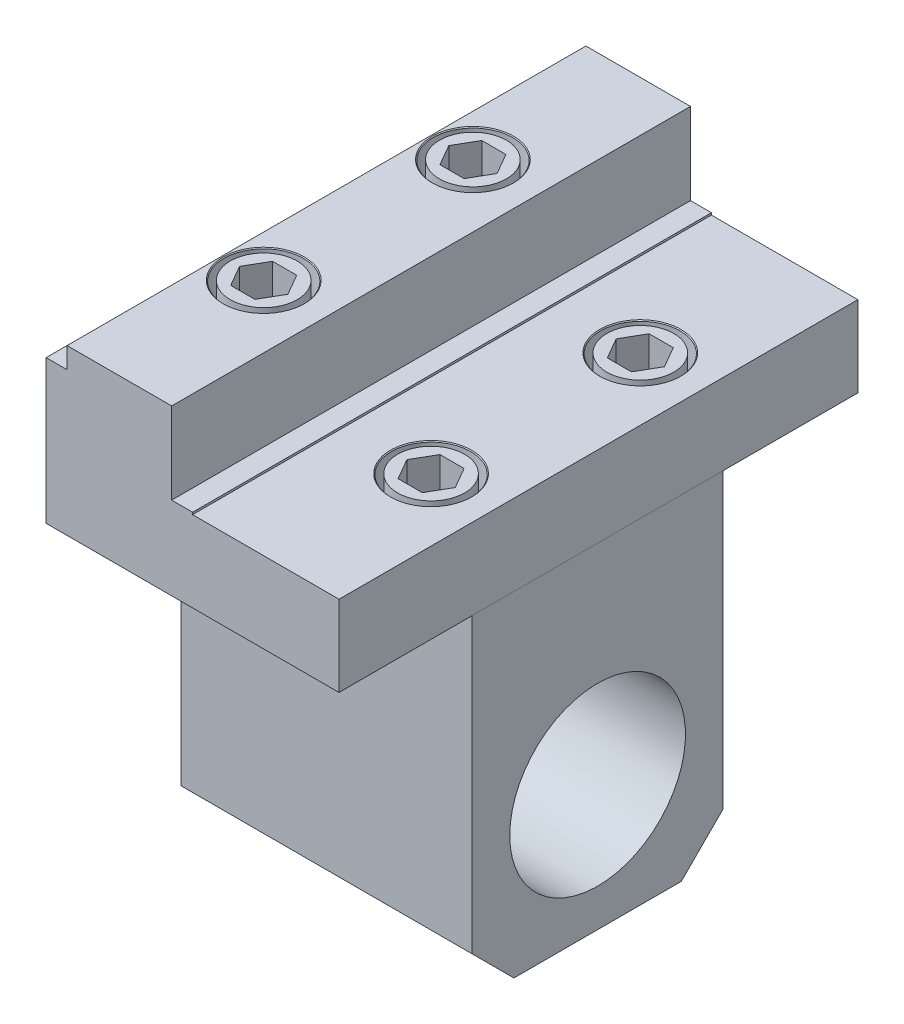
from build123d import *

# Parameters (mm, degrees)
BASIS_LINEAR_AUSTRAGEN_DEPTH         = 124
SCHNITT_LINEAR_AUSTRAGEN2_DEPTH      = 144.791515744
SCHNITT_LINEAR_AUSTRAGEN2_DEPTH_BACK = 144.791515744
SKIZZE2_R                            = 5.5
SKIZZE3_R                            = 9.5
SCHNITT_LINEAR_AUSTRAGEN3_DEPTH      = 10
SKIZZE5_R                            = 9.5
SCHNITT_LINEAR_AUSTRAGEN4_DEPTH      = 10
SKIZZE6_W                            = 35
SKIZZE6_H                            = 124
SCHNITT_LINEAR_AUSTRAGEN5_DEPTH      = 0.5
FASE10_SIZE                          = 0.2
SKIZZE7_W                            = 69.6
SKIZZE7_H                            = 60
AUFSATZ_LINEAR_AUSTRAGEN1_DEPTH      = 80
SKIZZE8_R                            = 21
SCHNITT_LINEAR_AUSTRAGEN6_DEPTH      = 164.242273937
FASE11_SIZE                          = 10
SKIZZE9_R                            = 8
AUFSATZ_LINEAR_AUSTRAGEN2_DEPTH      = 10
AUFSATZ_LINEAR_START                 = -1
SKIZZE9_2_R                          = 8
AUFSATZ_LINEAR_AUSTRAGEN3_DEPTH      = 1
SKIZZE11_R                           = 8
AUFSATZ_LINEAR_AUSTRAGEN4_DEPTH      = 9.5
AUFSATZ_LINEAR_START_2               = 1
SKIZZE11_3_R                         = 8
AUFSATZ_LINEAR_AUSTRAGEN5_DEPTH      = 1


with BuildPart() as part:
    # Skizze1 → Basis-Linear austragen (new body)
    with BuildSketch(Plane.XY):
        Polygon((0, 0), (0, 34.5), (5, 34.5), (5, 39.5), (30, 39.5), (30, 20), (70, 20), (70, 0), align=None)
    extrude(amount=-BASIS_LINEAR_AUSTRAGEN_DEPTH)

    # Skizze2 → Schnitt-Linear austragen2 (cut, two sides: drawn at the far end of the back side and taken through both)
    with BuildSketch(Plane(origin=(0, 20, 0), x_dir=(-1, 0, 0), z_dir=(0, 1, 0)).offset(-SCHNITT_LINEAR_AUSTRAGEN2_DEPTH_BACK)):
        with Locations(Location((-55, -87, 0), (0, 0, 90))):
            Circle(SKIZZE2_R)
        with Locations(Location((-55, -37, 0), (0, 0, 90))):
            Circle(SKIZZE2_R)
        with Locations(Location((-15, -87, 0), (0, 0, 90))):
            Circle(SKIZZE2_R)
        with Locations(Location((-15, -37, 0), (0, 0, 90))):
            Circle(SKIZZE2_R)
    extrude(amount=SCHNITT_LINEAR_AUSTRAGEN2_DEPTH + SCHNITT_LINEAR_AUSTRAGEN2_DEPTH_BACK, mode=Mode.SUBTRACT)

    # Skizze3 → Schnitt-Linear austragen3 (cut)
    with BuildSketch(Plane(origin=(0, 20, 0), x_dir=(-1, 0, 0), z_dir=(0, 1, 0))):
        with Locations(Location((-55, -87, 0), (0, 0, 90))):
            Circle(SKIZZE3_R)
        with Locations(Location((-55, -37, 0), (0, 0, 90))):
            Circle(SKIZZE3_R)
    extrude(amount=-SCHNITT_LINEAR_AUSTRAGEN3_DEPTH, mode=Mode.SUBTRACT)

    # Skizze5 → Schnitt-Linear austragen4 (cut)
    with BuildSketch(Plane(origin=(0, 39.5, 0), x_dir=(-1, 0, 0), z_dir=(0, 1, 0))):
        with Locations(Location((-15, -87, 0), (0, 0, 90))):
            Circle(SKIZZE5_R)
        with Locations(Location((-15, -37, 0), (0, 0, 90))):
            Circle(SKIZZE5_R)
    extrude(amount=-SCHNITT_LINEAR_AUSTRAGEN4_DEPTH, mode=Mode.SUBTRACT)

    # Skizze6 → Schnitt-Linear austragen5 (cut)
    with BuildSketch(Plane(origin=(0, 20, 0), x_dir=(-1, 0, 0), z_dir=(0, 1, 0))):
        with Locations((-52.5, -62)):
            Rectangle(SKIZZE6_W, SKIZZE6_H)
    extrude(amount=-SCHNITT_LINEAR_AUSTRAGEN5_DEPTH, mode=Mode.SUBTRACT)

    # Fase10
    fase10_edges = [part.edges().sort_by_distance(p)[0] for p in [
        (35, 0, 0),
        (0, 0, -62),
        (70, 0, -62),
        (55, 0, -92.5),
        (55, 0, -42.5),
        (15, 0, -92.5),
        (15, 0, -42.5),
        (35, 0, -124),
        (15, 39.5, -96.5),
        (15, 39.5, -46.5),
        (55, 19.5, -96.5),
        (55, 19.5, -46.5),
    ]]
    chamfer(fase10_edges, length=FASE10_SIZE)

    # Skizze9 → Aufsatz-Linear austragen2 (add)
    # profile 1 of 2: a face of its own
    with BuildSketch(Plane(origin=(0, 29.5, 0), x_dir=(1, 0, 0), z_dir=(0, 1, 0))):
        with Locations(Location((15, 37, 0), (0, 0, 270))):
            Circle(SKIZZE9_R)
        Polygon((12.113248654, 32), (17.886751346, 32), (20.773502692, 37), (17.886751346, 42), (12.113248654, 42), (9.226497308, 37), align=None, mode=Mode.SUBTRACT)
    # profile 2 of 2: a face of its own
    with BuildSketch(Plane(origin=(0, 29.5, 0), x_dir=(1, 0, 0), z_dir=(0, 1, 0))):
        with Locations(Location((15, 87, 0), (0, 0, 90))):
            Circle(SKIZZE9_R)
        Polygon((9.226497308, 87), (12.113248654, 92), (17.886751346, 92), (20.773502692, 87), (17.886751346, 82), (12.113248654, 82), align=None, mode=Mode.SUBTRACT)
    extrude(amount=AUFSATZ_LINEAR_AUSTRAGEN2_DEPTH)

    # Skizze9_2 → Aufsatz-Linear austragen3 (add)
    with BuildSketch(Plane(origin=(0, 29.5, 0), x_dir=(1, 0, 0), z_dir=(0, 1, 0)).offset(AUFSATZ_LINEAR_START)):
        with Locations(Location((15, 37, 0), (0, 0, 270))):
            Circle(SKIZZE9_2_R)
        with Locations(Location((15, 87, 0), (0, 0, 90))):
            Circle(SKIZZE9_2_R)
    extrude(amount=AUFSATZ_LINEAR_AUSTRAGEN3_DEPTH)

    # Skizze11 → Aufsatz-Linear austragen4 (add)
    # profile 1 of 2: a face of its own
    with BuildSketch(Plane(origin=(0, 10, -10), x_dir=(-1, 0, 0), z_dir=(0, -1, 0))):
        with Locations(Location((-55, 27, 0), (0, 0, 270))):
            Circle(SKIZZE11_R)
        Polygon((-57.886751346, 22), (-52.113248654, 22), (-49.226497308, 27), (-52.113248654, 32), (-57.886751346, 32), (-60.773502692, 27), align=None, mode=Mode.SUBTRACT)
    # profile 2 of 2: a face of its own
    with BuildSketch(Plane(origin=(0, 10, -10), x_dir=(-1, 0, 0), z_dir=(0, -1, 0))):
        with Locations(Location((-55, 77, 0), (0, 0, 270))):
            Circle(SKIZZE11_R)
        Polygon((-49.226497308, 77), (-52.113248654, 82), (-57.886751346, 82), (-60.773502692, 77), (-57.886751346, 72), (-52.113248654, 72), align=None, mode=Mode.SUBTRACT)
    extrude(amount=-AUFSATZ_LINEAR_AUSTRAGEN4_DEPTH)

    # Skizze11_3 → Aufsatz-Linear austragen5 (add)
    with BuildSketch(Plane(origin=(0, 10, -10), x_dir=(-1, 0, 0), z_dir=(0, -1, 0)).offset(AUFSATZ_LINEAR_START_2)):
        with Locations(Location((-55, 27, 0), (0, 0, 270))):
            Circle(SKIZZE11_3_R)
        with Locations(Location((-55, 77, 0), (0, 0, 270))):
            Circle(SKIZZE11_3_R)
    extrude(amount=-AUFSATZ_LINEAR_AUSTRAGEN5_DEPTH)


with BuildPart() as body_2:
    # Skizze7 → Aufsatz-Linear austragen1 (new body)
    with BuildSketch(Plane.XZ):
        with Locations((35, -62)):
            Rectangle(SKIZZE7_W, SKIZZE7_H)
    extrude(amount=AUFSATZ_LINEAR_AUSTRAGEN1_DEPTH)

    # Skizze8 → Schnitt-Linear austragen6 (cut, through all)
    with BuildSketch(Plane.ZY.offset(-0.2)):
        with Locations((-62, -50)):
            Circle(SKIZZE8_R)
    extrude(amount=-SCHNITT_LINEAR_AUSTRAGEN6_DEPTH, mode=Mode.SUBTRACT)

    # Fase11
    fase11_edges = [body_2.edges().sort_by_distance(p)[0] for p in [
        (35, -80, -92),
        (35, -80, -32),
    ]]
    chamfer(fase11_edges, length=FASE11_SIZE)


solid = Compound([part.part, body_2.part])
